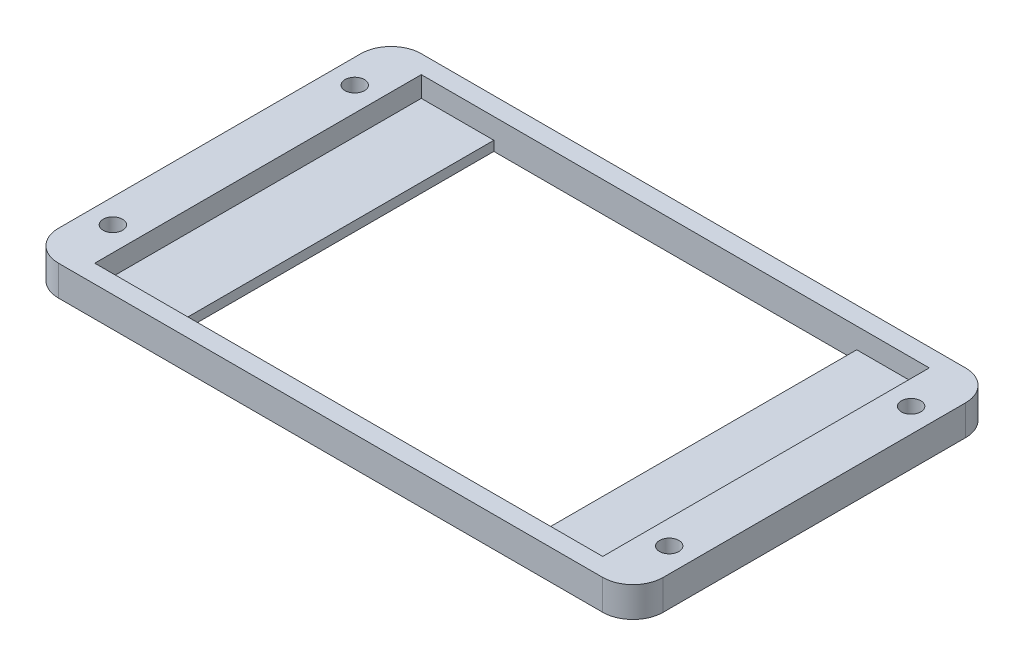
from build123d import *

# Parameters (mm, degrees)
SKETCH1_W           = 127
SKETCH1_H           = 76.2
BOSS_EXTRUDE1_DEPTH = 6.35
SKETCH2_W           = 106.68
SKETCH2_H           = 68.58
CUT_EXTRUDE2_DEPTH  = 4.318
SKETCH4_W           = 76.2
SKETCH4_H           = 68.58
CUT_EXTRUDE3_DEPTH  = 149.169109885
SKETCH5_R           = 2.032
CUT_EXTRUDE4_DEPTH  = 149.24224263
FILLET1_R           = 6.35


with BuildPart() as part:
    # Sketch1 → Boss-Extrude1 (new body)
    with BuildSketch(Plane(origin=(0, 0, 0), x_dir=(1, 0, 0), z_dir=(0, 1, 0))):
        with Locations((63.5, 38.1)):
            Rectangle(SKETCH1_W, SKETCH1_H)
    extrude(amount=BOSS_EXTRUDE1_DEPTH)

    # Sketch2 → Cut-Extrude2 (cut)
    with BuildSketch(Plane(origin=(0, 6.35, 0), x_dir=(1, 0, 0), z_dir=(0, 1, 0))):
        with Locations((63.5, 38.1)):
            Rectangle(SKETCH2_W, SKETCH2_H)
    extrude(amount=-CUT_EXTRUDE2_DEPTH, mode=Mode.SUBTRACT)

    # Sketch4 → Cut-Extrude3 (cut, through all)
    with BuildSketch(Plane(origin=(0, 2.032, 0), x_dir=(1, 0, 0), z_dir=(0, 1, 0))):
        with Locations((63.5, 38.1)):
            Rectangle(SKETCH4_W, SKETCH4_H)
    extrude(amount=-CUT_EXTRUDE3_DEPTH, mode=Mode.SUBTRACT)

    # Sketch5 → Cut-Extrude4 (cut, through all)
    with BuildSketch(Plane(origin=(0, 6.35, 0), x_dir=(1, 0, 0), z_dir=(0, 1, 0))):
        with Locations(Location((5.08, 63.5, 0), (0, 0, 270))):
            Circle(SKETCH5_R)
        with Locations(Location((5.08, 12.7, 0), (0, 0, 270))):
            Circle(SKETCH5_R)
        with Locations(Location((121.92, 63.5, 0), (0, 0, 270))):
            Circle(SKETCH5_R)
        with Locations(Location((121.92, 12.7, 0), (0, 0, 270))):
            Circle(SKETCH5_R)
    extrude(amount=-CUT_EXTRUDE4_DEPTH, mode=Mode.SUBTRACT)

    # Fillet1
    fillet1_edges = [part.edges().sort_by_distance(p)[0] for p in [
        (0, 3.175, -76.2),
        (127, 3.175, -76.2),
        (127, 3.175, 0),
        (0, 3.175, 0),
    ]]
    fillet(fillet1_edges, radius=FILLET1_R)


solid = part.part
